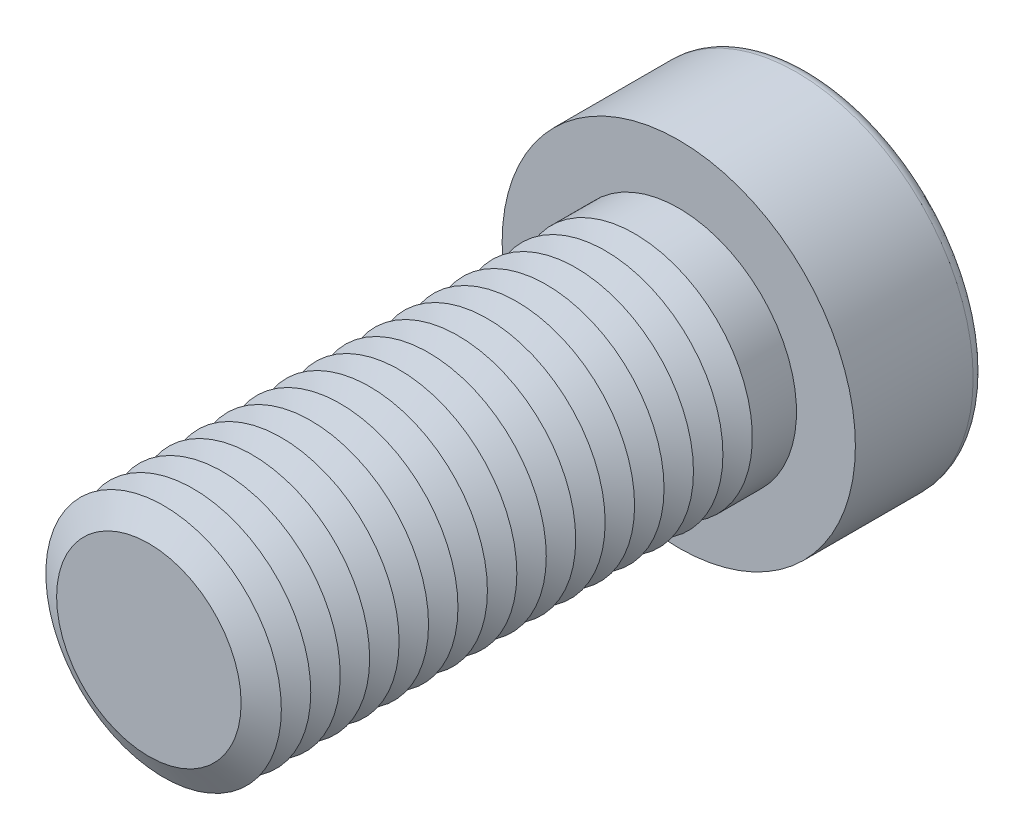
from build123d import *

# Parameters (mm, degrees)
SKETCH1_R           = 10
BOSS_EXTRUDE1_DEPTH = 45
SKETCH2_R           = 15
BOSS_EXTRUDE2_DEPTH = 11
CUT_EXTRUDE1_DEPTH  = 10.5
FILLET1_R           = 1
LPATTERN1_COUNT     = 17
LPATTERN1_PITCH     = 2.5


with BuildPart() as part:
    # Sketch1 → Boss-Extrude1 (new body)
    with BuildSketch(Plane.XY):
        with Locations(Location((0, 0, 0), (0, 0, 180))):
            Circle(SKETCH1_R)
    extrude(amount=BOSS_EXTRUDE1_DEPTH)

    # Sketch2 → Boss-Extrude2 (add)
    with BuildSketch(Plane(origin=(0, 0, 0), x_dir=(-1, 0, 0), z_dir=(0, 0, -1))):
        Circle(SKETCH2_R)
    extrude(amount=BOSS_EXTRUDE2_DEPTH)

    # Sketch3 → Cut-Extrude1 (cut)
    with BuildSketch(Plane(origin=(0, 0, -11), x_dir=(-1, 0, 0), z_dir=(0, 0, -1))):
        Polygon((-4.041451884, 7), (-8.082903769, 0), (-4.041451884, -7), (4.041451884, -7), (8.082903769, 0), (4.041451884, 7), align=None)
    extrude(amount=-CUT_EXTRUDE1_DEPTH, mode=Mode.SUBTRACT)

    # Fillet1
    fillet1_edges = [part.edges().sort_by_distance(p)[0] for p in [
        (15, 0, -11),
    ]]
    fillet(fillet1_edges, radius=FILLET1_R)

    # Cut-Extrude2 cone 1 section (on through the dimple's axis) → Cut-Extrude2 (revolve, cut)
    with BuildSketch(Plane(origin=(0, 0, -0.5), x_dir=(0, 1, 0), z_dir=(1, 0, 0))):
        Polygon((0, 0), (7, 0), (0, 4.041451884), align=None)
    revolve(axis=Axis((0, 0, -0.5), (0, 0, 1)), mode=Mode.SUBTRACT)

    # Cut-Extrude3 cone 1 section (on through the dimple's axis) → Cut-Extrude3 (revolve, cut)
    with BuildSketch(Plane(origin=(0, 0, -11), x_dir=(0, 1, 0), z_dir=(1, 0, 0))):
        Polygon((0, 0), (8.082903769, 0), (0, 2.165807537), align=None)
    revolve(axis=Axis((0, 0, -11), (0, 0, 1)), mode=Mode.SUBTRACT)

    # Sketch7 → Cut-Revolve1 (revolve, cut)
    with BuildSketch(Plane(origin=(0, 0, 0), x_dir=(0, 0, -1), z_dir=(1, 0, 0)), mode=Mode.PRIVATE) as cut_revolve1_sk:
        Polygon((-45, 7.834936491), (-43.75, 10), (-46.25, 10), align=None)
    cut_revolve1 = revolve(cut_revolve1_sk.sketch.rotate(Axis((0, 0, 45), (0, 0, -1)), 270), axis=Axis((0, 0, 45), (0, 0, -1)), mode=Mode.SUBTRACT)

    # LPattern1: Cut-Revolve1 ×17
    with Locations(*[(0, 0, -i * LPATTERN1_PITCH) for i in range(1, LPATTERN1_COUNT)]):
        add(cut_revolve1, mode=Mode.SUBTRACT)


solid = part.part
